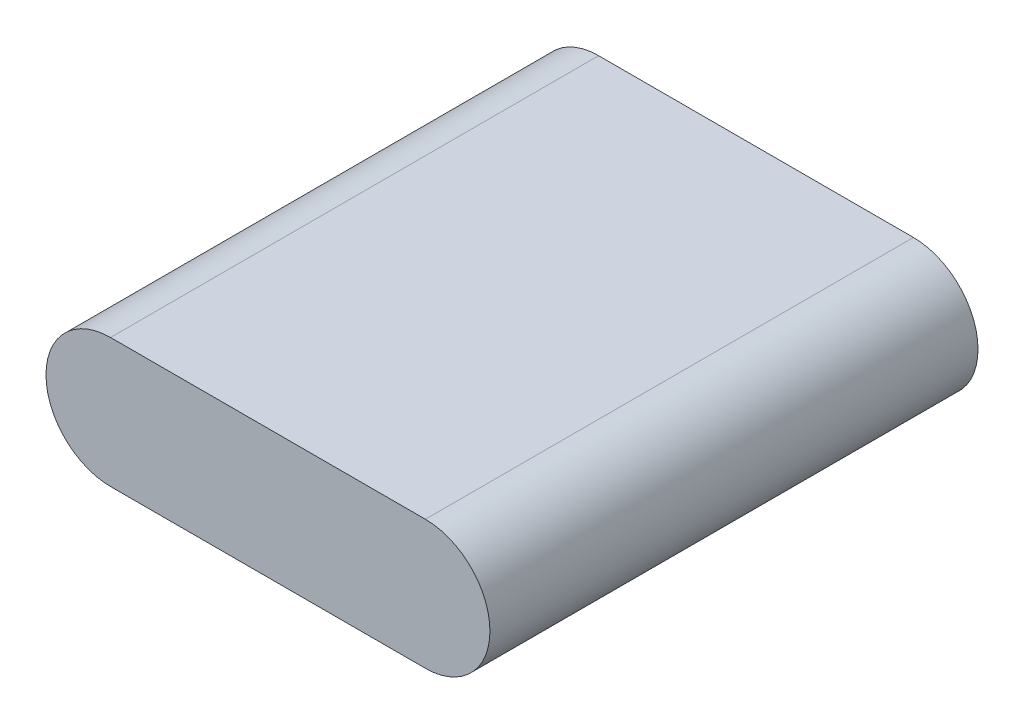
from build123d import *

# Parameters (mm, degrees)
BOSS_EXTRUDE1_DEPTH = 42.545


with BuildPart() as part:
    # Sketch1 → Boss-Extrude1 (new, symmetric)
    with BuildSketch(Plane.XY):
        with BuildLine():
            Line((-27.4447, 11.2522), (27.4447, 11.2522))
            ThreePointArc((27.4447, 11.2522), (38.6969, 0), (27.4447, -11.2522))
            Line((27.4447, -11.2522), (-27.4447, -11.2522))
            ThreePointArc((-27.4447, -11.2522), (-38.6969, 0), (-27.4447, 11.2522))
        make_face()
    extrude(amount=BOSS_EXTRUDE1_DEPTH, both=True)


solid = part.part
